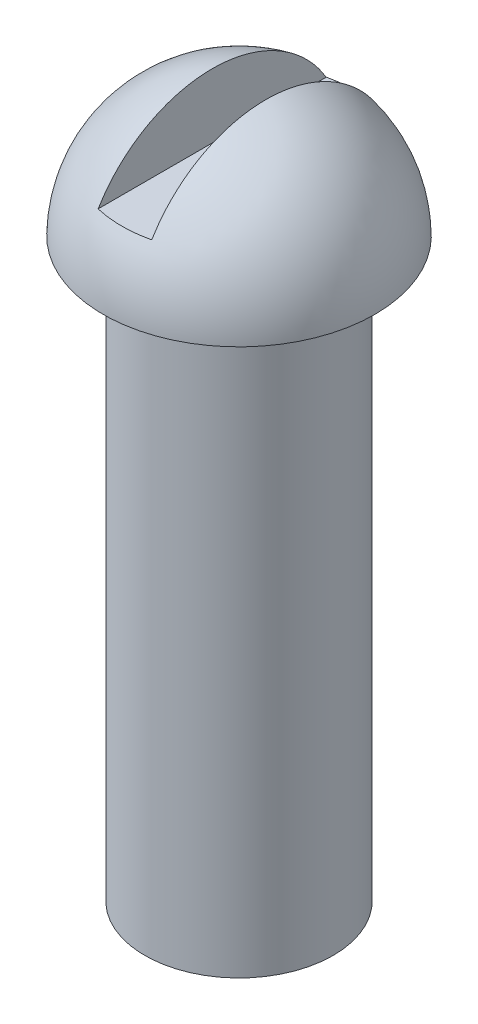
from build123d import *

# Parameters (mm, degrees)
CUT_EXTRUDE1_DEPTH      = 24.028962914
CUT_EXTRUDE1_DEPTH_BACK = 24.028962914


with BuildPart() as part:
    # Sketch1 → Base-Revolve (revolve)
    with BuildSketch(Plane.XY):
        with BuildLine():
            Line((5.1562, 0), (3.571875, 0))
            Line((3.571875, 0), (3.571875, -21.844))
            Line((3.571875, -21.844), (0, -21.844))
            Line((0, -21.844), (0, 5.08))
            ThreePointArc((0, 5.08), (3.619143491, 3.596659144), (5.1562, 0))
        make_face()
    revolve(axis=Axis((0, 10.110523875, 0), (0, -1, 0)))

    # Sketch2 → Cut-Extrude1 (cut, two sides: drawn at the far end of the back side and taken through both)
    with BuildSketch(Plane.XY.offset(-CUT_EXTRUDE1_DEPTH_BACK)):
        with BuildLine():
            Line((-1.016, 4.978921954), (-1.016, 2.54))
            Line((-1.016, 2.54), (1.016, 2.54))
            Line((1.016, 2.54), (1.016, 4.978921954))
            ThreePointArc((1.016, 4.978921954), (0, 5.08), (-1.016, 4.978921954))
        make_face()
    extrude(amount=CUT_EXTRUDE1_DEPTH + CUT_EXTRUDE1_DEPTH_BACK, mode=Mode.SUBTRACT)


solid = part.part
